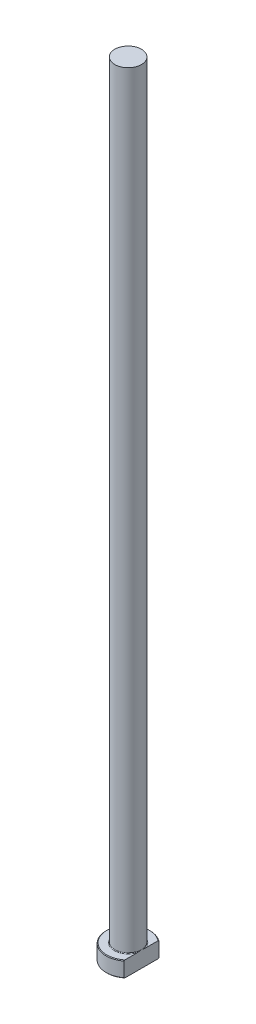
ISO-10303-21;
HEADER;
FILE_DESCRIPTION(('STEP AP214'),'2;1');
FILE_NAME('part.step','',(''),(''),'','','');
FILE_SCHEMA(('AUTOMOTIVE_DESIGN { 1 0 10303 214 1 1 1 1 }'));
ENDSEC;
DATA;
#1=APPLICATION_CONTEXT('core data for automotive mechanical design processes');
#2=APPLICATION_PROTOCOL_DEFINITION('international standard','automotive_design',2000,#1);
#3=PRODUCT_CONTEXT('',#1,'mechanical');
#4=PRODUCT('Part','Part','',(#3));
#5=PRODUCT_RELATED_PRODUCT_CATEGORY('part','',(#4));
#6=PRODUCT_DEFINITION_FORMATION('','',#4);
#7=PRODUCT_DEFINITION_CONTEXT('part definition',#1,'design');
#8=PRODUCT_DEFINITION('design','',#6,#7);
#9=PRODUCT_DEFINITION_SHAPE('','',#8);
#10=(LENGTH_UNIT() NAMED_UNIT(*) SI_UNIT(.MILLI.,.METRE.));
#11=(NAMED_UNIT(*) PLANE_ANGLE_UNIT() SI_UNIT($,.RADIAN.));
#12=(NAMED_UNIT(*) SI_UNIT($,.STERADIAN.) SOLID_ANGLE_UNIT());
#13=UNCERTAINTY_MEASURE_WITH_UNIT(LENGTH_MEASURE(1.E-05),#10,'distance_accuracy_value','');
#14=(GEOMETRIC_REPRESENTATION_CONTEXT(3) GLOBAL_UNCERTAINTY_ASSIGNED_CONTEXT((#13)) GLOBAL_UNIT_ASSIGNED_CONTEXT((#10,
#11,#12)) REPRESENTATION_CONTEXT('',''));
#15=CARTESIAN_POINT('',(0.,0.,0.));
#16=DIRECTION('',(0.,0.,1.));
#17=DIRECTION('',(1.,0.,0.));
#18=AXIS2_PLACEMENT_3D('',#15,#16,#17);
#19=CARTESIAN_POINT('',(0.,0.,0.));
#20=DIRECTION('',(0.,-1.,0.));
#21=DIRECTION('',(0.,0.,-1.));
#22=AXIS2_PLACEMENT_3D('',#19,#20,#21);
#23=PLANE('',#22);
#24=CARTESIAN_POINT('',(0.,0.,0.));
#25=DIRECTION('',(0.,-1.,0.));
#26=DIRECTION('',(0.,0.,-1.));
#27=AXIS2_PLACEMENT_3D('',#24,#25,#26);
#28=CIRCLE('',#27,6.79999999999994);
#29=CARTESIAN_POINT('',(4.24999999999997,0.,5.30824829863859));
#30=VERTEX_POINT('',#29);
#31=CARTESIAN_POINT('',(4.24999999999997,0.,-5.30824829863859));
#32=VERTEX_POINT('',#31);
#33=EDGE_CURVE('E98',#30,#32,#28,.T.);
#34=ORIENTED_EDGE('',*,*,#33,.T.);
#35=DIRECTION('',(0.,0.,1.));
#36=VECTOR('',#35,1.);
#37=CARTESIAN_POINT('',(4.24999999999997,0.,-5.56214886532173));
#38=LINE('',#37,#36);
#39=EDGE_CURVE('E83',#32,#30,#38,.T.);
#40=ORIENTED_EDGE('',*,*,#39,.T.);
#41=EDGE_LOOP('',(#34,#40));
#42=FACE_BOUND('',#41,.T.);
#43=ADVANCED_FACE('F32',(#42),#23,.T.);
#44=CARTESIAN_POINT('',(0.,259.958771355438,0.));
#45=DIRECTION('',(0.,1.,0.));
#46=DIRECTION('',(0.,0.,1.));
#47=AXIS2_PLACEMENT_3D('',#44,#45,#46);
#48=CYLINDRICAL_SURFACE('',#47,6.99999999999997);
#49=CARTESIAN_POINT('',(0.,4.80000000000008,0.));
#50=DIRECTION('',(0.,1.,0.));
#51=DIRECTION('',(0.,0.,1.));
#52=AXIS2_PLACEMENT_3D('',#49,#50,#51);
#53=CIRCLE('',#52,6.99999999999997);
#54=CARTESIAN_POINT('',(4.24999999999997,4.80000000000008,5.56214886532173));
#55=VERTEX_POINT('',#54);
#56=CARTESIAN_POINT('',(4.24999999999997,4.80000000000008,-5.56214886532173));
#57=VERTEX_POINT('',#56);
#58=EDGE_CURVE('E104',#55,#57,#53,.F.);
#59=ORIENTED_EDGE('',*,*,#58,.T.);
#60=DIRECTION('',(0.,-1.,0.));
#61=VECTOR('',#60,1.);
#62=CARTESIAN_POINT('',(4.24999999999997,250.,-5.56214886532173));
#63=LINE('',#62,#61);
#64=CARTESIAN_POINT('',(4.24999999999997,0.200000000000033,-5.56214886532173));
#65=VERTEX_POINT('',#64);
#66=EDGE_CURVE('E183',#57,#65,#63,.T.);
#67=ORIENTED_EDGE('',*,*,#66,.T.);
#68=CARTESIAN_POINT('',(0.,0.200000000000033,0.));
#69=DIRECTION('',(0.,-1.,0.));
#70=DIRECTION('',(0.,0.,-1.));
#71=AXIS2_PLACEMENT_3D('',#68,#69,#70);
#72=CIRCLE('',#71,6.99999999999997);
#73=CARTESIAN_POINT('',(4.24999999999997,0.200000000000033,5.56214886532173));
#74=VERTEX_POINT('',#73);
#75=EDGE_CURVE('E100',#65,#74,#72,.F.);
#76=ORIENTED_EDGE('',*,*,#75,.T.);
#77=DIRECTION('',(0.,-1.,0.));
#78=VECTOR('',#77,1.);
#79=CARTESIAN_POINT('',(4.24999999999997,250.,5.56214886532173));
#80=LINE('',#79,#78);
#81=EDGE_CURVE('E93',#55,#74,#80,.T.);
#82=ORIENTED_EDGE('',*,*,#81,.F.);
#83=EDGE_LOOP('',(#59,#67,#76,#82));
#84=FACE_BOUND('',#83,.T.);
#85=ADVANCED_FACE('F158',(#84),#48,.T.);
#86=CARTESIAN_POINT('',(-6.99999999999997,5.,0.));
#87=DIRECTION('',(0.,1.,0.));
#88=DIRECTION('',(0.,0.,1.));
#89=AXIS2_PLACEMENT_3D('',#86,#87,#88);
#90=PLANE('',#89);
#91=CARTESIAN_POINT('',(0.,5.,0.));
#92=DIRECTION('',(0.,1.,0.));
#93=DIRECTION('',(0.,0.,1.));
#94=AXIS2_PLACEMENT_3D('',#91,#92,#93);
#95=CIRCLE('',#94,6.80000000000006);
#96=CARTESIAN_POINT('',(4.24999999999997,5.,-5.30824829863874));
#97=VERTEX_POINT('',#96);
#98=CARTESIAN_POINT('',(4.24999999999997,5.,5.30824829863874));
#99=VERTEX_POINT('',#98);
#100=EDGE_CURVE('E178',#97,#99,#95,.T.);
#101=ORIENTED_EDGE('',*,*,#100,.T.);
#102=DIRECTION('',(0.,0.,-1.));
#103=VECTOR('',#102,1.);
#104=CARTESIAN_POINT('',(4.24999999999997,5.,0.));
#105=LINE('',#104,#103);
#106=CARTESIAN_POINT('',(4.24999999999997,4.99999999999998,1.31909059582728));
#107=VERTEX_POINT('',#106);
#108=EDGE_CURVE('E57',#99,#107,#105,.T.);
#109=ORIENTED_EDGE('',*,*,#108,.T.);
#110=CARTESIAN_POINT('',(0.,5.,0.));
#111=DIRECTION('',(0.,1.,0.));
#112=DIRECTION('',(0.,0.,1.));
#113=AXIS2_PLACEMENT_3D('',#110,#111,#112);
#114=CIRCLE('',#113,4.44999999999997);
#115=CARTESIAN_POINT('',(4.24999999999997,4.99999999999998,-1.31909059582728));
#116=VERTEX_POINT('',#115);
#117=EDGE_CURVE('E107',#107,#116,#114,.F.);
#118=ORIENTED_EDGE('',*,*,#117,.T.);
#119=EDGE_CURVE('E136',#116,#97,#105,.T.);
#120=ORIENTED_EDGE('',*,*,#119,.T.);
#121=EDGE_LOOP('',(#101,#109,#118,#120));
#122=FACE_BOUND('',#121,.T.);
#123=ADVANCED_FACE('F147',(#122),#90,.T.);
#124=CARTESIAN_POINT('',(0.,5.,0.));
#125=DIRECTION('',(0.,-1.,0.));
#126=DIRECTION('',(0.,0.,-1.));
#127=AXIS2_PLACEMENT_3D('',#124,#125,#126);
#128=CONICAL_SURFACE('',#127,6.80000000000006,0.785398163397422);
#129=ORIENTED_EDGE('',*,*,#58,.F.);
#130=CARTESIAN_POINT('',(4.24999999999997,-1.1549717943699,12.2380061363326));
#131=CARTESIAN_POINT('',(4.24999999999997,-0.96860090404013,12.0407126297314));
#132=CARTESIAN_POINT('',(4.24999999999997,-0.782481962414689,11.843180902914));
#133=CARTESIAN_POINT('',(4.24999999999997,-0.410835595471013,11.4475596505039));
#134=CARTESIAN_POINT('',(4.24999999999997,-0.225308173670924,11.2494701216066));
#135=CARTESIAN_POINT('',(4.24999999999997,0.330615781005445,10.6538566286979));
#136=CARTESIAN_POINT('',(4.24999999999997,0.699987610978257,10.2553749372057));
#137=CARTESIAN_POINT('',(4.24999999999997,1.44820689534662,9.44056382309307));
#138=CARTESIAN_POINT('',(4.24999999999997,1.82691721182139,9.02410803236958));
#139=CARTESIAN_POINT('',(4.24999999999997,2.3903883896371,8.39564122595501));
#140=CARTESIAN_POINT('',(4.24999999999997,2.5773639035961,8.18561642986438));
#141=CARTESIAN_POINT('',(4.24999999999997,2.94948531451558,7.76395344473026));
#142=CARTESIAN_POINT('',(4.24999999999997,3.1346312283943,7.55231527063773));
#143=CARTESIAN_POINT('',(4.24999999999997,3.50243810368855,7.12729701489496));
#144=CARTESIAN_POINT('',(4.24999999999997,3.68510158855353,6.91391912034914));
#145=CARTESIAN_POINT('',(4.24999999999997,4.04753998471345,6.48470257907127));
#146=CARTESIAN_POINT('',(4.24999999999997,4.22731476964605,6.26886382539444));
#147=CARTESIAN_POINT('',(4.24999999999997,4.58362310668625,5.83346482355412));
#148=CARTESIAN_POINT('',(4.24999999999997,4.76014565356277,5.61389554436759));
#149=CARTESIAN_POINT('',(4.24999999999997,5.10813954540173,5.17081545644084));
#150=CARTESIAN_POINT('',(4.24999999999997,5.27961153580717,4.94730515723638));
#151=CARTESIAN_POINT('',(4.24999999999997,5.61292794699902,4.49883470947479));
#152=CARTESIAN_POINT('',(4.24999999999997,5.77488381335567,4.2739577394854));
#153=CARTESIAN_POINT('',(4.24999999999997,6.08959034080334,3.8175542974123));
#154=CARTESIAN_POINT('',(4.24999999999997,6.24233528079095,3.58602382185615));
#155=CARTESIAN_POINT('',(4.24999999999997,6.46088242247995,3.23296927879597));
#156=CARTESIAN_POINT('',(4.24999999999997,6.53180994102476,3.11461948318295));
#157=CARTESIAN_POINT('',(4.24999999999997,6.66953191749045,2.87554671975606));
#158=CARTESIAN_POINT('',(4.24999999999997,6.73632692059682,2.75482406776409));
#159=CARTESIAN_POINT('',(4.24999999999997,6.86480050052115,2.51086229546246));
#160=CARTESIAN_POINT('',(4.24999999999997,6.92648531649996,2.38762647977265));
#161=CARTESIAN_POINT('',(4.24999999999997,7.04367856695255,2.13827051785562));
#162=CARTESIAN_POINT('',(4.24999999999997,7.09918867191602,2.0121511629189));
#163=CARTESIAN_POINT('',(4.24999999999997,7.20212054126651,1.75821381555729));
#164=CARTESIAN_POINT('',(4.24999999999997,7.24962333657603,1.63042897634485));
#165=CARTESIAN_POINT('',(4.24999999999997,7.33574687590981,1.37182854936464));
#166=CARTESIAN_POINT('',(4.24999999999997,7.37436534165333,1.24101219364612));
#167=CARTESIAN_POINT('',(4.24999999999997,7.44090399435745,0.977431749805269));
#168=CARTESIAN_POINT('',(4.24999999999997,7.46888314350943,0.844682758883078));
#169=CARTESIAN_POINT('',(4.24999999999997,7.51300819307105,0.577216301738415));
#170=CARTESIAN_POINT('',(4.24999999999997,7.52915548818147,0.442499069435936));
#171=CARTESIAN_POINT('',(4.24999999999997,7.54874331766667,0.170860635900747));
#172=CARTESIAN_POINT('',(4.24999999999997,7.55206380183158,0.0339306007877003));
#173=CARTESIAN_POINT('',(4.24999999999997,7.54544836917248,-0.239598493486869));
#174=CARTESIAN_POINT('',(4.24999999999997,7.53551276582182,-0.376197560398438));
#175=CARTESIAN_POINT('',(4.24999999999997,7.50295253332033,-0.648437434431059));
#176=CARTESIAN_POINT('',(4.24999999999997,7.48027427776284,-0.784071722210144));
#177=CARTESIAN_POINT('',(4.24999999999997,7.42348982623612,-1.05291460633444));
#178=CARTESIAN_POINT('',(4.24999999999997,7.38938084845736,-1.18612260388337));
#179=CARTESIAN_POINT('',(4.24999999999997,7.29188531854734,-1.51531404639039));
#180=CARTESIAN_POINT('',(4.24999999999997,7.22238075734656,-1.70947814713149));
#181=CARTESIAN_POINT('',(4.24999999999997,7.06668741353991,-2.0909759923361));
#182=CARTESIAN_POINT('',(4.24999999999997,6.9804865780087,-2.278304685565));
#183=CARTESIAN_POINT('',(4.24999999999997,6.84149476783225,-2.55552751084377));
#184=CARTESIAN_POINT('',(4.24999999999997,6.79327931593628,-2.64776502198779));
#185=CARTESIAN_POINT('',(4.24999999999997,6.69413480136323,-2.83077431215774));
#186=CARTESIAN_POINT('',(4.24999999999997,6.64320570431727,-2.92154607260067));
#187=CARTESIAN_POINT('',(4.24999999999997,6.53904474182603,-3.10170103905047));
#188=CARTESIAN_POINT('',(4.24999999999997,6.4858138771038,-3.19108482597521));
#189=CARTESIAN_POINT('',(4.24999999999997,6.3773472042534,-3.368618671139));
#190=CARTESIAN_POINT('',(4.24999999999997,6.32211148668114,-3.45676878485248));
#191=CARTESIAN_POINT('',(4.24999999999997,6.13027123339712,-3.75631659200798));
#192=CARTESIAN_POINT('',(4.24999999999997,5.98947006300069,-3.9650308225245));
#193=CARTESIAN_POINT('',(4.24999999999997,5.70061349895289,-4.37739745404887));
#194=CARTESIAN_POINT('',(4.24999999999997,5.55255625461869,-4.58104854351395));
#195=CARTESIAN_POINT('',(4.24999999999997,5.25096308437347,-4.98451036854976));
#196=CARTESIAN_POINT('',(4.24999999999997,5.09742258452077,-5.1843176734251));
#197=CARTESIAN_POINT('',(4.24999999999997,4.78630665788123,-5.58072220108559));
#198=CARTESIAN_POINT('',(4.24999999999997,4.62873161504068,-5.77731972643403));
#199=CARTESIAN_POINT('',(4.24999999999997,4.30987074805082,-6.16866624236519));
#200=CARTESIAN_POINT('',(4.24999999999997,4.14857352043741,-6.36340591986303));
#201=CARTESIAN_POINT('',(4.24999999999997,3.82349048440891,-6.75079948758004));
#202=CARTESIAN_POINT('',(4.24999999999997,3.65970462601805,-6.94345333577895));
#203=CARTESIAN_POINT('',(4.24999999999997,3.33022176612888,-7.32695469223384));
#204=CARTESIAN_POINT('',(4.24999999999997,3.16452573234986,-7.51780303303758));
#205=CARTESIAN_POINT('',(4.24999999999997,2.83151234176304,-7.89808083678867));
#206=CARTESIAN_POINT('',(4.24999999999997,2.66419497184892,-8.08751028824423));
#207=CARTESIAN_POINT('',(4.24999999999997,2.19674563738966,-8.61299836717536));
#208=CARTESIAN_POINT('',(4.24999999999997,1.89516668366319,-8.94776953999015));
#209=CARTESIAN_POINT('',(4.24999999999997,1.28890266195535,-9.61456394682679));
#210=CARTESIAN_POINT('',(4.24999999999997,0.984217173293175,-9.94658679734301));
#211=CARTESIAN_POINT('',(4.24999999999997,0.374739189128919,-10.6061264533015));
#212=CARTESIAN_POINT('',(4.24999999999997,0.0699631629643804,-10.9336584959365));
#213=CARTESIAN_POINT('',(4.24999999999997,-0.541317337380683,-11.5870007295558));
#214=CARTESIAN_POINT('',(4.24999999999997,-0.847821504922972,-11.9128112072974));
#215=CARTESIAN_POINT('',(4.24999999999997,-1.15497179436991,-12.2380061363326));
#216=B_SPLINE_CURVE_WITH_KNOTS('',3,(#130,#131,#132,#133,#134,#135,#136,#137,#138,#139,#140,
#141,#142,#143,#144,#145,#146,#147,#148,#149,#150,#151,#152,#153,#154,#155,#156,#157,#158,#159,
#160,#161,#162,#163,#164,#165,#166,#167,#168,#169,#170,#171,#172,#173,#174,#175,#176,#177,#178,
#179,#180,#181,#182,#183,#184,#185,#186,#187,#188,#189,#190,#191,#192,#193,#194,#195,#196,#197,
#198,#199,#200,#201,#202,#203,#204,#205,#206,#207,#208,#209,#210,#211,#212,#213,#214,#215),
.UNSPECIFIED.,.F.,.F.,(4,2,2,2,2,2,2,2,2,2,2,2,2,2,2,2,2,2,2,2,2,2,2,2,2,2,2,2,2,2,2,2,2,2,2,2,
2,2,2,2,2,2,4),(0.,0.814204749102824,1.62841433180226,3.25843263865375,4.94708916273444,
5.79066412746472,6.63423128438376,7.47686481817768,8.31953511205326,9.16466757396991,
10.0096915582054,10.8409260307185,11.6726715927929,12.0865355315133,12.500344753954,
12.9136410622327,13.3268252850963,13.7355380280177,14.1443554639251,14.5508730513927,
14.9573427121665,15.3676075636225,15.777862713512,16.1898574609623,16.6019525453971,
17.2195383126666,17.8375715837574,18.1497730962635,18.461978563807,18.7740496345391,
19.0861066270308,19.8411596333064,20.5964062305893,21.3522982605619,22.1081186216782,
22.8666854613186,23.6252675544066,24.3834808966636,25.141700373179,26.4934084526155,
27.845302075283,29.1874909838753,30.5294487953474),.UNSPECIFIED.);
#217=EDGE_CURVE('E135',#55,#99,#216,.T.);
#218=ORIENTED_EDGE('',*,*,#217,.T.);
#219=ORIENTED_EDGE('',*,*,#100,.F.);
#220=EDGE_CURVE('E127',#97,#57,#216,.T.);
#221=ORIENTED_EDGE('',*,*,#220,.T.);
#222=EDGE_LOOP('',(#129,#218,#219,#221));
#223=FACE_BOUND('',#222,.T.);
#224=ADVANCED_FACE('F143',(#223),#128,.T.);
#225=CARTESIAN_POINT('',(0.,0.200000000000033,0.));
#226=DIRECTION('',(0.,1.,0.));
#227=DIRECTION('',(0.,0.,1.));
#228=AXIS2_PLACEMENT_3D('',#225,#226,#227);
#229=CONICAL_SURFACE('',#228,6.99999999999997,0.785398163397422);
#230=ORIENTED_EDGE('',*,*,#75,.F.);
#231=CARTESIAN_POINT('',(4.24999999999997,6.15497179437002,-12.2380061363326));
#232=CARTESIAN_POINT('',(4.24999999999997,5.96860090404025,-12.0407126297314));
#233=CARTESIAN_POINT('',(4.24999999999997,5.78248196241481,-11.843180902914));
#234=CARTESIAN_POINT('',(4.24999999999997,5.41083559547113,-11.4475596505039));
#235=CARTESIAN_POINT('',(4.24999999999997,5.22530817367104,-11.2494701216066));
#236=CARTESIAN_POINT('',(4.24999999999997,4.66938421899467,-10.6538566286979));
#237=CARTESIAN_POINT('',(4.24999999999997,4.30001238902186,-10.2553749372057));
#238=CARTESIAN_POINT('',(4.24999999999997,3.5517931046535,-9.44056382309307));
#239=CARTESIAN_POINT('',(4.24999999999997,3.17308278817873,-9.02410803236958));
#240=CARTESIAN_POINT('',(4.24999999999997,2.60961161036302,-8.39564122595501));
#241=CARTESIAN_POINT('',(4.24999999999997,2.42263609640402,-8.18561642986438));
#242=CARTESIAN_POINT('',(4.24999999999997,2.05051468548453,-7.76395344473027));
#243=CARTESIAN_POINT('',(4.24999999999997,1.86536877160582,-7.55231527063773));
#244=CARTESIAN_POINT('',(4.24999999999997,1.49756189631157,-7.12729701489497));
#245=CARTESIAN_POINT('',(4.24999999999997,1.31489841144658,-6.91391912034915));
#246=CARTESIAN_POINT('',(4.24999999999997,0.95246001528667,-6.48470257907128));
#247=CARTESIAN_POINT('',(4.24999999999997,0.772685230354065,-6.26886382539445));
#248=CARTESIAN_POINT('',(4.24999999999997,0.416376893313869,-5.83346482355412));
#249=CARTESIAN_POINT('',(4.24999999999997,0.239854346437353,-5.61389554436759));
#250=CARTESIAN_POINT('',(4.24999999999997,-0.108139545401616,-5.17081545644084));
#251=CARTESIAN_POINT('',(4.24999999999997,-0.279611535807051,-4.94730515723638));
#252=CARTESIAN_POINT('',(4.24999999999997,-0.612927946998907,-4.4988347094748));
#253=CARTESIAN_POINT('',(4.24999999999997,-0.77488381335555,-4.2739577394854));
#254=CARTESIAN_POINT('',(4.24999999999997,-1.08959034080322,-3.8175542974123));
#255=CARTESIAN_POINT('',(4.24999999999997,-1.24233528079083,-3.58602382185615));
#256=CARTESIAN_POINT('',(4.24999999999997,-1.46088242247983,-3.23296927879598));
#257=CARTESIAN_POINT('',(4.24999999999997,-1.53180994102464,-3.11461948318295));
#258=CARTESIAN_POINT('',(4.24999999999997,-1.66953191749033,-2.87554671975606));
#259=CARTESIAN_POINT('',(4.24999999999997,-1.7363269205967,-2.75482406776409));
#260=CARTESIAN_POINT('',(4.24999999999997,-1.86480050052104,-2.51086229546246));
#261=CARTESIAN_POINT('',(4.24999999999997,-1.92648531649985,-2.38762647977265));
#262=CARTESIAN_POINT('',(4.24999999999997,-2.04367856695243,-2.13827051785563));
#263=CARTESIAN_POINT('',(4.24999999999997,-2.0991886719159,-2.0121511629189));
#264=CARTESIAN_POINT('',(4.24999999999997,-2.20212054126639,-1.75821381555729));
#265=CARTESIAN_POINT('',(4.24999999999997,-2.24962333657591,-1.63042897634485));
#266=CARTESIAN_POINT('',(4.24999999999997,-2.33574687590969,-1.37182854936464));
#267=CARTESIAN_POINT('',(4.24999999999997,-2.37436534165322,-1.24101219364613));
#268=CARTESIAN_POINT('',(4.24999999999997,-2.44090399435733,-0.977431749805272));
#269=CARTESIAN_POINT('',(4.24999999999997,-2.46888314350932,-0.844682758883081));
#270=CARTESIAN_POINT('',(4.24999999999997,-2.51300819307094,-0.577216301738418));
#271=CARTESIAN_POINT('',(4.24999999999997,-2.52915548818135,-0.44249906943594));
#272=CARTESIAN_POINT('',(4.24999999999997,-2.54874331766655,-0.170860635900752));
#273=CARTESIAN_POINT('',(4.24999999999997,-2.55206380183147,-0.0339306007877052));
#274=CARTESIAN_POINT('',(4.24999999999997,-2.54544836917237,0.239598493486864));
#275=CARTESIAN_POINT('',(4.24999999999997,-2.5355127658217,0.376197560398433));
#276=CARTESIAN_POINT('',(4.24999999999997,-2.50295253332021,0.648437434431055));
#277=CARTESIAN_POINT('',(4.24999999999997,-2.48027427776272,0.784071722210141));
#278=CARTESIAN_POINT('',(4.24999999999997,-2.42348982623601,1.05291460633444));
#279=CARTESIAN_POINT('',(4.24999999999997,-2.38938084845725,1.18612260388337));
#280=CARTESIAN_POINT('',(4.24999999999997,-2.29188531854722,1.51531404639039));
#281=CARTESIAN_POINT('',(4.24999999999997,-2.22238075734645,1.70947814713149));
#282=CARTESIAN_POINT('',(4.24999999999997,-2.0666874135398,2.09097599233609));
#283=CARTESIAN_POINT('',(4.24999999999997,-1.98048657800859,2.278304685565));
#284=CARTESIAN_POINT('',(4.24999999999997,-1.84149476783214,2.55552751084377));
#285=CARTESIAN_POINT('',(4.24999999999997,-1.79327931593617,2.64776502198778));
#286=CARTESIAN_POINT('',(4.24999999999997,-1.69413480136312,2.83077431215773));
#287=CARTESIAN_POINT('',(4.24999999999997,-1.64320570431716,2.92154607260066));
#288=CARTESIAN_POINT('',(4.24999999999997,-1.53904474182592,3.10170103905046));
#289=CARTESIAN_POINT('',(4.24999999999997,-1.48581387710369,3.1910848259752));
#290=CARTESIAN_POINT('',(4.24999999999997,-1.37734720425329,3.36861867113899));
#291=CARTESIAN_POINT('',(4.24999999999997,-1.32211148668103,3.45676878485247));
#292=CARTESIAN_POINT('',(4.24999999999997,-1.13027123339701,3.75631659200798));
#293=CARTESIAN_POINT('',(4.24999999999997,-0.989470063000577,3.96503082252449));
#294=CARTESIAN_POINT('',(4.24999999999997,-0.700613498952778,4.37739745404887));
#295=CARTESIAN_POINT('',(4.24999999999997,-0.552556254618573,4.58104854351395));
#296=CARTESIAN_POINT('',(4.24999999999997,-0.250963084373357,4.98451036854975));
#297=CARTESIAN_POINT('',(4.24999999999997,-0.0974225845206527,5.1843176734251));
#298=CARTESIAN_POINT('',(4.24999999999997,0.213693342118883,5.58072220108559));
#299=CARTESIAN_POINT('',(4.24999999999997,0.371268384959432,5.77731972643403));
#300=CARTESIAN_POINT('',(4.24999999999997,0.690129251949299,6.16866624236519));
#301=CARTESIAN_POINT('',(4.24999999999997,0.851426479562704,6.36340591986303));
#302=CARTESIAN_POINT('',(4.24999999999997,1.17650951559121,6.75079948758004));
#303=CARTESIAN_POINT('',(4.24999999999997,1.34029537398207,6.94345333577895));
#304=CARTESIAN_POINT('',(4.24999999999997,1.66977823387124,7.32695469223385));
#305=CARTESIAN_POINT('',(4.24999999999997,1.83547426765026,7.51780303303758));
#306=CARTESIAN_POINT('',(4.24999999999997,2.16848765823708,7.89808083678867));
#307=CARTESIAN_POINT('',(4.24999999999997,2.3358050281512,8.08751028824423));
#308=CARTESIAN_POINT('',(4.24999999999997,2.80325436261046,8.61299836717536));
#309=CARTESIAN_POINT('',(4.24999999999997,3.10483331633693,8.94776953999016));
#310=CARTESIAN_POINT('',(4.24999999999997,3.71109733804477,9.6145639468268));
#311=CARTESIAN_POINT('',(4.24999999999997,4.01578282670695,9.94658679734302));
#312=CARTESIAN_POINT('',(4.24999999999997,4.6252608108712,10.6061264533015));
#313=CARTESIAN_POINT('',(4.24999999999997,4.93003683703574,10.9336584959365));
#314=CARTESIAN_POINT('',(4.24999999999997,5.5413173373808,11.5870007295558));
#315=CARTESIAN_POINT('',(4.24999999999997,5.84782150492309,11.9128112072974));
#316=CARTESIAN_POINT('',(4.24999999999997,6.15497179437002,12.2380061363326));
#317=B_SPLINE_CURVE_WITH_KNOTS('',3,(#231,#232,#233,#234,#235,#236,#237,#238,#239,#240,#241,
#242,#243,#244,#245,#246,#247,#248,#249,#250,#251,#252,#253,#254,#255,#256,#257,#258,#259,#260,
#261,#262,#263,#264,#265,#266,#267,#268,#269,#270,#271,#272,#273,#274,#275,#276,#277,#278,#279,
#280,#281,#282,#283,#284,#285,#286,#287,#288,#289,#290,#291,#292,#293,#294,#295,#296,#297,#298,
#299,#300,#301,#302,#303,#304,#305,#306,#307,#308,#309,#310,#311,#312,#313,#314,#315,#316),
.UNSPECIFIED.,.F.,.F.,(4,2,2,2,2,2,2,2,2,2,2,2,2,2,2,2,2,2,2,2,2,2,2,2,2,2,2,2,2,2,2,2,2,2,2,2,
2,2,2,2,2,2,4),(0.,0.814204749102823,1.62841433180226,3.25843263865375,4.94708916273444,
5.79066412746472,6.63423128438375,7.47686481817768,8.31953511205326,9.16466757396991,
10.0096915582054,10.8409260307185,11.6726715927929,12.0865355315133,12.500344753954,
12.9136410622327,13.3268252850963,13.7355380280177,14.1443554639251,14.5508730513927,
14.9573427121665,15.3676075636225,15.777862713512,16.1898574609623,16.6019525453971,
17.2195383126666,17.8375715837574,18.1497730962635,18.461978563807,18.7740496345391,
19.0861066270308,19.8411596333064,20.5964062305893,21.3522982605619,22.1081186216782,
22.8666854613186,23.6252675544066,24.3834808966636,25.141700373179,26.4934084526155,
27.845302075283,29.1874909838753,30.5294487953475),.UNSPECIFIED.);
#318=EDGE_CURVE('E86',#65,#32,#317,.T.);
#319=ORIENTED_EDGE('',*,*,#318,.T.);
#320=ORIENTED_EDGE('',*,*,#33,.F.);
#321=EDGE_CURVE('E89',#30,#74,#317,.T.);
#322=ORIENTED_EDGE('',*,*,#321,.T.);
#323=EDGE_LOOP('',(#230,#319,#320,#322));
#324=FACE_BOUND('',#323,.T.);
#325=ADVANCED_FACE('F97',(#324),#229,.T.);
#326=CARTESIAN_POINT('',(0.,5.19999999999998,0.));
#327=DIRECTION('',(0.,1.,0.));
#328=DIRECTION('',(0.,0.,1.));
#329=AXIS2_PLACEMENT_3D('',#326,#327,#328);
#330=TOROIDAL_SURFACE('',#329,4.44999999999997,0.2);
#331=CARTESIAN_POINT('',(4.24999999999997,5.19999999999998,0.));
#332=CARTESIAN_POINT('',(4.24999999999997,5.20000051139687,1.15744821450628E-10));
#333=CARTESIAN_POINT('',(4.24999999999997,5.20000102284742,-2.4293169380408E-07));
#334=CARTESIAN_POINT('',(4.24999999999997,5.20000197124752,-8.87321860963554E-07));
#335=CARTESIAN_POINT('',(4.24999999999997,5.20000238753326,-1.30614850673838E-06));
#336=CARTESIAN_POINT('',(4.24999999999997,5.20000327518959,-2.31752643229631E-06));
#337=CARTESIAN_POINT('',(4.24999999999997,5.20000373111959,-2.92646131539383E-06));
#338=CARTESIAN_POINT('',(4.24999999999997,5.200004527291,-4.16981951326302E-06));
#339=CARTESIAN_POINT('',(4.24999999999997,5.2000048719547,-4.80170872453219E-06));
#340=CARTESIAN_POINT('',(4.24999999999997,5.20000620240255,-7.3194814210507E-06));
#341=CARTESIAN_POINT('',(4.24999999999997,5.20000712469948,-9.24257745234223E-06));
#342=CARTESIAN_POINT('',(4.24999999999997,5.20000859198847,-1.29952261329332E-05));
#343=CARTESIAN_POINT('',(4.24999999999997,5.20000916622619,-1.48137375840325E-05));
#344=CARTESIAN_POINT('',(4.24999999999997,5.20001166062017,-2.2701068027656E-05));
#345=CARTESIAN_POINT('',(4.24999999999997,5.20001358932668,-2.87689532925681E-05));
#346=CARTESIAN_POINT('',(4.24999999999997,5.20001634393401,-4.00958698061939E-05));
#347=CARTESIAN_POINT('',(4.24999999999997,5.20001729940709,-4.53228601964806E-05));
#348=CARTESIAN_POINT('',(4.24999999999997,5.20002438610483,-8.47086375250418E-05));
#349=CARTESIAN_POINT('',(4.24999999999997,5.20002990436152,-0.000118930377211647));
#350=CARTESIAN_POINT('',(4.24999999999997,5.20005405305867,-0.000255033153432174));
#351=CARTESIAN_POINT('',(4.24999999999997,5.20007694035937,-0.00035616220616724));
#352=CARTESIAN_POINT('',(4.24999999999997,5.20016675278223,-0.000759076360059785));
#353=CARTESIAN_POINT('',(4.24999999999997,5.20023104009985,-0.00106124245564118));
#354=CARTESIAN_POINT('',(4.24999999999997,5.20048990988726,-0.00226975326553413));
#355=CARTESIAN_POINT('',(4.24999999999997,5.20068789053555,-0.00317558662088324));
#356=CARTESIAN_POINT('',(4.24999999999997,5.20151472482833,-0.00696787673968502));
#357=CARTESIAN_POINT('',(4.24999999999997,5.2021393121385,-0.00985497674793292));
#358=CARTESIAN_POINT('',(4.24999999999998,5.21047485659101,-0.0483744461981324));
#359=CARTESIAN_POINT('',(4.24999999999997,5.21821166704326,-0.0840032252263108));
#360=CARTESIAN_POINT('',(4.24999999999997,5.23443934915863,-0.15925743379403));
#361=CARTESIAN_POINT('',(4.24999999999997,5.24291807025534,-0.198885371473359));
#362=CARTESIAN_POINT('',(4.24999999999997,5.25719269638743,-0.266483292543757));
#363=CARTESIAN_POINT('',(4.24999999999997,5.2630418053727,-0.294441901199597));
#364=CARTESIAN_POINT('',(4.24999999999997,5.27443459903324,-0.349631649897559));
#365=CARTESIAN_POINT('',(4.24999999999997,5.27998226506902,-0.37686197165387));
#366=CARTESIAN_POINT('',(4.24999999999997,5.29789349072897,-0.466265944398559));
#367=CARTESIAN_POINT('',(4.24999999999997,5.3098841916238,-0.528515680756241));
#368=CARTESIAN_POINT('',(4.24999999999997,5.33255488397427,-0.653873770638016));
#369=CARTESIAN_POINT('',(4.24999999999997,5.34322118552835,-0.716984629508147));
#370=CARTESIAN_POINT('',(4.24999999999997,5.36341886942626,-0.849542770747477));
#371=CARTESIAN_POINT('',(4.24999999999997,5.37274606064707,-0.919022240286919));
#372=CARTESIAN_POINT('',(4.24999999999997,5.38787342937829,-1.05816998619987));
#373=CARTESIAN_POINT('',(4.24999999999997,5.39368393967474,-1.12783709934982));
#374=CARTESIAN_POINT('',(4.24999999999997,5.40022105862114,-1.26519903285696));
#375=CARTESIAN_POINT('',(4.24999999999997,5.40110718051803,-1.33288413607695));
#376=CARTESIAN_POINT('',(4.24999999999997,5.39715260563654,-1.43372383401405));
#377=CARTESIAN_POINT('',(4.24999999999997,5.39498924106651,-1.46697561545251));
#378=CARTESIAN_POINT('',(4.24999999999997,5.38843757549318,-1.53323057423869));
#379=CARTESIAN_POINT('',(4.24999999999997,5.38405165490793,-1.56623397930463));
#380=CARTESIAN_POINT('',(4.24999999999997,5.37221191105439,-1.63225744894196));
#381=CARTESIAN_POINT('',(4.24999999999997,5.36471302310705,-1.665270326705));
#382=CARTESIAN_POINT('',(4.24999999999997,5.35002141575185,-1.71373529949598));
#383=CARTESIAN_POINT('',(4.24999999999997,5.3445543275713,-1.72970598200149));
#384=CARTESIAN_POINT('',(4.24999999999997,5.33212858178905,-1.76104662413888));
#385=CARTESIAN_POINT('',(4.24999999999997,5.32517291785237,-1.77641771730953));
#386=CARTESIAN_POINT('',(4.24999999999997,5.31157493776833,-1.80173413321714));
#387=CARTESIAN_POINT('',(4.24999999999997,5.30543892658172,-1.81194868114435));
#388=CARTESIAN_POINT('',(4.24999999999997,5.29187259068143,-1.83147712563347));
#389=CARTESIAN_POINT('',(4.24999999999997,5.28444659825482,-1.84079387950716));
#390=CARTESIAN_POINT('',(4.24999999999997,5.27165788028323,-1.8539962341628));
#391=CARTESIAN_POINT('',(4.24999999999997,5.26687308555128,-1.85843752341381));
#392=CARTESIAN_POINT('',(4.24999999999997,5.25674280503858,-1.86663816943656));
#393=CARTESIAN_POINT('',(4.24999999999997,5.25139780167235,-1.87039810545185));
#394=CARTESIAN_POINT('',(4.24999999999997,5.24121545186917,-1.87633128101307));
#395=CARTESIAN_POINT('',(4.24999999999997,5.23647607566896,-1.87867040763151));
#396=CARTESIAN_POINT('',(4.24999999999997,5.22667692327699,-1.88254109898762));
#397=CARTESIAN_POINT('',(4.24999999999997,5.22161755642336,-1.88407367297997));
#398=CARTESIAN_POINT('',(4.24999999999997,5.21125115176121,-1.88618376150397));
#399=CARTESIAN_POINT('',(4.24999999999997,5.20594232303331,-1.8867527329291));
#400=CARTESIAN_POINT('',(4.24999999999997,5.1953165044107,-1.88683483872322));
#401=CARTESIAN_POINT('',(4.24999999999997,5.18999951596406,-1.88634814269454));
#402=CARTESIAN_POINT('',(4.24999999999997,5.18024254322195,-1.88451305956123));
#403=CARTESIAN_POINT('',(4.24999999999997,5.17577879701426,-1.88328567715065));
#404=CARTESIAN_POINT('',(4.24999999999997,5.16708370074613,-1.88018632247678));
#405=CARTESIAN_POINT('',(4.24999999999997,5.16285244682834,-1.87831408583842));
#406=CARTESIAN_POINT('',(4.24999999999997,5.15236530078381,-1.8728422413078));
#407=CARTESIAN_POINT('',(4.24999999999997,5.14630821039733,-1.86886321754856));
#408=CARTESIAN_POINT('',(4.24999999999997,5.13488065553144,-1.8600173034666));
#409=CARTESIAN_POINT('',(4.24999999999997,5.12951236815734,-1.85514771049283));
#410=CARTESIAN_POINT('',(4.24999999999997,5.11550691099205,-1.84083719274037));
#411=CARTESIAN_POINT('',(4.24999999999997,5.10752788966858,-1.83075903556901));
#412=CARTESIAN_POINT('',(4.24999999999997,5.09305704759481,-1.80961650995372));
#413=CARTESIAN_POINT('',(4.24999999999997,5.08656786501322,-1.7985504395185));
#414=CARTESIAN_POINT('',(4.24999999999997,5.07270261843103,-1.77195183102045));
#415=CARTESIAN_POINT('',(4.24999999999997,5.06578110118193,-1.75618509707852));
#416=CARTESIAN_POINT('',(4.24999999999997,5.05343494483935,-1.72406513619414));
#417=CARTESIAN_POINT('',(4.24999999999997,5.04801326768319,-1.70771081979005));
#418=CARTESIAN_POINT('',(4.24999999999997,5.03828568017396,-1.67446840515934));
#419=CARTESIAN_POINT('',(4.24999999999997,5.03399373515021,-1.65757628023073));
#420=CARTESIAN_POINT('',(4.24999999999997,5.02638165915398,-1.62359857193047));
#421=CARTESIAN_POINT('',(4.24999999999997,5.02306049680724,-1.60651321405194));
#422=CARTESIAN_POINT('',(4.24999999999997,5.01554103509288,-1.56237813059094));
#423=CARTESIAN_POINT('',(4.24999999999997,5.01193061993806,-1.53522860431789));
#424=CARTESIAN_POINT('',(4.24999999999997,5.00624732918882,-1.48076491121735));
#425=CARTESIAN_POINT('',(4.24999999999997,5.00417529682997,-1.45345066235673));
#426=CARTESIAN_POINT('',(4.24999999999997,4.99980704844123,-1.37123328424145));
#427=CARTESIAN_POINT('',(4.24999999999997,4.99938405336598,-1.31623108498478));
#428=CARTESIAN_POINT('',(4.24999999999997,5.00195512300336,-1.20937484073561));
#429=CARTESIAN_POINT('',(4.24999999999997,5.00476235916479,-1.15751417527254));
#430=CARTESIAN_POINT('',(4.24999999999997,5.01274020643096,-1.05395255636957));
#431=CARTESIAN_POINT('',(4.24999999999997,5.0179120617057,-1.00225170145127));
#432=CARTESIAN_POINT('',(4.24999999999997,5.0318667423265,-0.883772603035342));
#433=CARTESIAN_POINT('',(4.24999999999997,5.04126554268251,-0.817068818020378));
#434=CARTESIAN_POINT('',(4.24999999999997,5.06248695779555,-0.68230638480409));
#435=CARTESIAN_POINT('',(4.24999999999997,5.0743654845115,-0.614256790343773));
#436=CARTESIAN_POINT('',(4.24999999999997,5.09582131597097,-0.499048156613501));
#437=CARTESIAN_POINT('',(4.24999999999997,5.10500357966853,-0.451814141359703));
#438=CARTESIAN_POINT('',(4.24999999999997,5.1237965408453,-0.357991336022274));
#439=CARTESIAN_POINT('',(4.24999999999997,5.13340116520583,-0.311401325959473));
#440=CARTESIAN_POINT('',(4.24999999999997,5.15180561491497,-0.223687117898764));
#441=CARTESIAN_POINT('',(4.24999999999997,5.16056968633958,-0.182555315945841));
#442=CARTESIAN_POINT('',(4.24999999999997,5.178640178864,-0.0985301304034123));
#443=CARTESIAN_POINT('',(4.24999999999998,5.18795357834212,-0.0556381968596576));
#444=CARTESIAN_POINT('',(4.24999999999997,5.1978622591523,-0.00984762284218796));
#445=CARTESIAN_POINT('',(4.24999999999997,5.19848844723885,-0.00695317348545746));
#446=CARTESIAN_POINT('',(4.24999999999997,5.1993156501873,-0.00315924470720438));
#447=CARTESIAN_POINT('',(4.24999999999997,5.19951238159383,-0.00225911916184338));
#448=CARTESIAN_POINT('',(4.24999999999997,5.19976973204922,-0.00105770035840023));
#449=CARTESIAN_POINT('',(4.24999999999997,5.19983372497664,-0.000756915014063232));
#450=CARTESIAN_POINT('',(4.24999999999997,5.19992318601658,-0.000355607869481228));
#451=CARTESIAN_POINT('',(4.24999999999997,5.19994602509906,-0.000254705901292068));
#452=CARTESIAN_POINT('',(4.24999999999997,5.1999701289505,-0.000118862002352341));
#453=CARTESIAN_POINT('',(4.24999999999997,5.19997564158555,-8.4670569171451E-05));
#454=CARTESIAN_POINT('',(4.24999999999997,5.19998271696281,-4.53159337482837E-05));
#455=CARTESIAN_POINT('',(4.24999999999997,5.19998367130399,-4.00904844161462E-05));
#456=CARTESIAN_POINT('',(4.24999999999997,5.19998642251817,-2.87668536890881E-05));
#457=CARTESIAN_POINT('',(4.24999999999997,5.19998834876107,-2.27006335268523E-05));
#458=CARTESIAN_POINT('',(4.24999999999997,5.19999084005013,-1.48150638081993E-05));
#459=CARTESIAN_POINT('',(4.24999999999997,5.199991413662,-1.29966656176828E-05));
#460=CARTESIAN_POINT('',(4.24999999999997,5.19999287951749,-9.24415318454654E-06));
#461=CARTESIAN_POINT('',(4.24999999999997,5.19999380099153,-7.32106390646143E-06));
#462=CARTESIAN_POINT('',(4.24999999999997,5.19999513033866,-4.8031966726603E-06));
#463=CARTESIAN_POINT('',(4.24999999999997,5.19999547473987,-4.17124743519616E-06));
#464=CARTESIAN_POINT('',(4.24999999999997,5.19999627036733,-2.92772184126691E-06));
#465=CARTESIAN_POINT('',(4.24999999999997,5.19999672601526,-2.31867707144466E-06));
#466=CARTESIAN_POINT('',(4.24999999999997,5.19999761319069,-1.30704757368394E-06));
#467=CARTESIAN_POINT('',(4.24999999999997,5.19999802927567,-8.88090030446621E-07));
#468=CARTESIAN_POINT('',(4.24999999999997,5.19999897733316,-2.43359811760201E-07));
#469=CARTESIAN_POINT('',(4.24999999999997,5.19999948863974,-1.15736528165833E-10));
#470=CARTESIAN_POINT('',(4.24999999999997,5.19999999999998,0.));
#471=B_SPLINE_CURVE_WITH_KNOTS('',3,(#331,#332,#333,#334,#335,#336,#337,#338,#339,#340,#341,
#342,#343,#344,#345,#346,#347,#348,#349,#350,#351,#352,#353,#354,#355,#356,#357,#358,#359,#360,
#361,#362,#363,#364,#365,#366,#367,#368,#369,#370,#371,#372,#373,#374,#375,#376,#377,#378,#379,
#380,#381,#382,#383,#384,#385,#386,#387,#388,#389,#390,#391,#392,#393,#394,#395,#396,#397,#398,
#399,#400,#401,#402,#403,#404,#405,#406,#407,#408,#409,#410,#411,#412,#413,#414,#415,#416,#417,
#418,#419,#420,#421,#422,#423,#424,#425,#426,#427,#428,#429,#430,#431,#432,#433,#434,#435,#436,
#437,#438,#439,#440,#441,#442,#443,#444,#445,#446,#447,#448,#449,#450,#451,#452,#453,#454,#455,
#456,#457,#458,#459,#460,#461,#462,#463,#464,#465,#466,#467,#468,#469,#470),.UNSPECIFIED.,.T.,
.F.,(4,2,2,2,2,2,2,2,2,2,2,2,2,2,2,2,2,2,2,2,2,2,2,2,2,2,2,2,2,2,2,2,2,2,2,2,2,2,2,2,2,2,2,2,2,
2,2,2,2,2,2,2,2,2,2,2,2,2,2,2,2,2,2,2,2,2,2,2,2,4),(0.,1.56348638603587E-06,
3.34736003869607E-06,5.61252474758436E-06,7.7714730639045E-06,1.41498338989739E-05,
1.98654803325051E-05,3.89412506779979E-05,5.48646730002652E-05,0.000158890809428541,
0.000469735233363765,0.00139675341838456,0.00417812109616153,0.0130401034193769,
0.122414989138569,0.243989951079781,0.329681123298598,0.413050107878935,0.603220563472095,
0.795216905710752,1.00545960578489,1.21508152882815,1.41787186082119,1.51777979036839,
1.61758094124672,1.71888023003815,1.76947366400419,1.81996629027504,1.85565144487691,
1.89121899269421,1.91076085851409,1.93028603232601,1.94608264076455,1.9618594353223,
1.97777538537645,1.99368877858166,2.00752120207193,2.02135930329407,2.04297559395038,
2.06465860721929,2.10300421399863,2.14141720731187,2.19295510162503,2.24459405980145,
2.29684419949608,2.34903862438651,2.43114134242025,2.51328903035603,2.67811431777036,
2.83386590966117,2.98969954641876,3.19173551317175,3.39894587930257,3.54329728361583,
3.68600406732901,3.81216982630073,3.94384090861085,3.95272545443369,3.9554892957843,
3.9564120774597,3.95672222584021,3.95682615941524,3.95684207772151,3.95686114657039,
3.95686686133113,3.9568732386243,3.95687539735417,3.95687766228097,3.95687944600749,
3.95688100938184),.UNSPECIFIED.);
#472=CARTESIAN_POINT('',(4.24999999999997,5.19999999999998,0.));
#473=VERTEX_POINT('',#472);
#474=EDGE_CURVE('E11',#116,#473,#471,.T.);
#475=ORIENTED_EDGE('',*,*,#474,.F.);
#476=ORIENTED_EDGE('',*,*,#117,.F.);
#477=CARTESIAN_POINT('',(4.24999999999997,5.19999999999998,0.));
#478=CARTESIAN_POINT('',(4.24999999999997,5.1999994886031,-1.15744598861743E-10));
#479=CARTESIAN_POINT('',(4.24999999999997,5.19999897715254,2.42931693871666E-07));
#480=CARTESIAN_POINT('',(4.24999999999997,5.19999802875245,8.87321860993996E-07));
#481=CARTESIAN_POINT('',(4.24999999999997,5.1999976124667,1.30614850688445E-06));
#482=CARTESIAN_POINT('',(4.24999999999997,5.19999672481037,2.31752643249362E-06));
#483=CARTESIAN_POINT('',(4.24999999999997,5.19999626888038,2.92646131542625E-06));
#484=CARTESIAN_POINT('',(4.24999999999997,5.19999547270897,4.16981951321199E-06));
#485=CARTESIAN_POINT('',(4.24999999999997,5.19999512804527,4.8017087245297E-06));
#486=CARTESIAN_POINT('',(4.24999999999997,5.19999379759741,7.31948142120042E-06));
#487=CARTESIAN_POINT('',(4.24999999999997,5.19999287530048,9.24257745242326E-06));
#488=CARTESIAN_POINT('',(4.24999999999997,5.1999914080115,1.29952261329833E-05));
#489=CARTESIAN_POINT('',(4.24999999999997,5.19999083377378,1.48137375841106E-05));
#490=CARTESIAN_POINT('',(4.24999999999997,5.19998833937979,2.27010680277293E-05));
#491=CARTESIAN_POINT('',(4.24999999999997,5.19998641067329,2.87689532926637E-05));
#492=CARTESIAN_POINT('',(4.24999999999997,5.19998365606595,4.00958698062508E-05));
#493=CARTESIAN_POINT('',(4.24999999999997,5.19998270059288,4.53228601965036E-05));
#494=CARTESIAN_POINT('',(4.24999999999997,5.19997561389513,8.47086375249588E-05));
#495=CARTESIAN_POINT('',(4.24999999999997,5.19997009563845,0.000118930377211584));
#496=CARTESIAN_POINT('',(4.24999999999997,5.19994594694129,0.000255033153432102));
#497=CARTESIAN_POINT('',(4.24999999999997,5.1999230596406,0.000356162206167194));
#498=CARTESIAN_POINT('',(4.24999999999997,5.19983324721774,0.000759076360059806));
#499=CARTESIAN_POINT('',(4.24999999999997,5.19976895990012,0.00106124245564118));
#500=CARTESIAN_POINT('',(4.24999999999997,5.19951009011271,0.00226975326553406));
#501=CARTESIAN_POINT('',(4.24999999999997,5.19931210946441,0.00317558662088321));
#502=CARTESIAN_POINT('',(4.24999999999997,5.19848527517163,0.00696787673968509));
#503=CARTESIAN_POINT('',(4.24999999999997,5.19786068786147,0.00985497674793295));
#504=CARTESIAN_POINT('',(4.24999999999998,5.18952514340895,0.0483744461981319));
#505=CARTESIAN_POINT('',(4.24999999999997,5.1817883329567,0.0840032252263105));
#506=CARTESIAN_POINT('',(4.24999999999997,5.16556065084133,0.15925743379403));
#507=CARTESIAN_POINT('',(4.24999999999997,5.15708192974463,0.198885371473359));
#508=CARTESIAN_POINT('',(4.24999999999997,5.14280730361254,0.266483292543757));
#509=CARTESIAN_POINT('',(4.24999999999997,5.13695819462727,0.294441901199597));
#510=CARTESIAN_POINT('',(4.24999999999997,5.12556540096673,0.349631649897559));
#511=CARTESIAN_POINT('',(4.24999999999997,5.12001773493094,0.37686197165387));
#512=CARTESIAN_POINT('',(4.24999999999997,5.10210650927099,0.466265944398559));
#513=CARTESIAN_POINT('',(4.24999999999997,5.09011580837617,0.528515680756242));
#514=CARTESIAN_POINT('',(4.24999999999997,5.0674451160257,0.653873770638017));
#515=CARTESIAN_POINT('',(4.24999999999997,5.05677881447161,0.716984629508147));
#516=CARTESIAN_POINT('',(4.24999999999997,5.0365811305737,0.849542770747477));
#517=CARTESIAN_POINT('',(4.24999999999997,5.0272539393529,0.919022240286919));
#518=CARTESIAN_POINT('',(4.24999999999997,5.01212657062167,1.05816998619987));
#519=CARTESIAN_POINT('',(4.24999999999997,5.00631606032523,1.12783709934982));
#520=CARTESIAN_POINT('',(4.24999999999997,4.99977894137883,1.26519903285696));
#521=CARTESIAN_POINT('',(4.24999999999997,4.99889281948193,1.33288413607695));
#522=CARTESIAN_POINT('',(4.24999999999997,5.00284739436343,1.43372383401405));
#523=CARTESIAN_POINT('',(4.24999999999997,5.00501075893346,1.46697561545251));
#524=CARTESIAN_POINT('',(4.24999999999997,5.01156242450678,1.53323057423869));
#525=CARTESIAN_POINT('',(4.24999999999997,5.01594834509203,1.56623397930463));
#526=CARTESIAN_POINT('',(4.24999999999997,5.02778808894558,1.63225744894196));
#527=CARTESIAN_POINT('',(4.24999999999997,5.03528697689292,1.665270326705));
#528=CARTESIAN_POINT('',(4.24999999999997,5.04997858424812,1.71373529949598));
#529=CARTESIAN_POINT('',(4.24999999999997,5.05544567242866,1.72970598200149));
#530=CARTESIAN_POINT('',(4.24999999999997,5.06787141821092,1.76104662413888));
#531=CARTESIAN_POINT('',(4.24999999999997,5.0748270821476,1.77641771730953));
#532=CARTESIAN_POINT('',(4.24999999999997,5.08842506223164,1.80173413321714));
#533=CARTESIAN_POINT('',(4.24999999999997,5.09456107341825,1.81194868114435));
#534=CARTESIAN_POINT('',(4.24999999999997,5.10812740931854,1.83147712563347));
#535=CARTESIAN_POINT('',(4.24999999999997,5.11555340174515,1.84079387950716));
#536=CARTESIAN_POINT('',(4.24999999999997,5.12834211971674,1.8539962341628));
#537=CARTESIAN_POINT('',(4.24999999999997,5.13312691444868,1.85843752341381));
#538=CARTESIAN_POINT('',(4.24999999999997,5.14325719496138,1.86663816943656));
#539=CARTESIAN_POINT('',(4.24999999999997,5.14860219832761,1.87039810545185));
#540=CARTESIAN_POINT('',(4.24999999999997,5.15878454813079,1.87633128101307));
#541=CARTESIAN_POINT('',(4.24999999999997,5.16352392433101,1.87867040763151));
#542=CARTESIAN_POINT('',(4.24999999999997,5.17332307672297,1.88254109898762));
#543=CARTESIAN_POINT('',(4.24999999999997,5.17838244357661,1.88407367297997));
#544=CARTESIAN_POINT('',(4.24999999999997,5.18874884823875,1.88618376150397));
#545=CARTESIAN_POINT('',(4.24999999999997,5.19405767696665,1.8867527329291));
#546=CARTESIAN_POINT('',(4.24999999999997,5.20468349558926,1.88683483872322));
#547=CARTESIAN_POINT('',(4.24999999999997,5.2100004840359,1.88634814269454));
#548=CARTESIAN_POINT('',(4.24999999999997,5.21975745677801,1.88451305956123));
#549=CARTESIAN_POINT('',(4.24999999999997,5.2242212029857,1.88328567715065));
#550=CARTESIAN_POINT('',(4.24999999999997,5.23291629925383,1.88018632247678));
#551=CARTESIAN_POINT('',(4.24999999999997,5.23714755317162,1.87831408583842));
#552=CARTESIAN_POINT('',(4.24999999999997,5.24763469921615,1.8728422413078));
#553=CARTESIAN_POINT('',(4.24999999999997,5.25369178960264,1.86886321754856));
#554=CARTESIAN_POINT('',(4.24999999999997,5.26511934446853,1.8600173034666));
#555=CARTESIAN_POINT('',(4.24999999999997,5.27048763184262,1.85514771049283));
#556=CARTESIAN_POINT('',(4.24999999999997,5.28449308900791,1.84083719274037));
#557=CARTESIAN_POINT('',(4.24999999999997,5.29247211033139,1.83075903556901));
#558=CARTESIAN_POINT('',(4.24999999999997,5.30694295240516,1.80961650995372));
#559=CARTESIAN_POINT('',(4.24999999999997,5.31343213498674,1.7985504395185));
#560=CARTESIAN_POINT('',(4.24999999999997,5.32729738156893,1.77195183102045));
#561=CARTESIAN_POINT('',(4.24999999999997,5.33421889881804,1.75618509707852));
#562=CARTESIAN_POINT('',(4.24999999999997,5.34656505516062,1.72406513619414));
#563=CARTESIAN_POINT('',(4.24999999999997,5.35198673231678,1.70771081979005));
#564=CARTESIAN_POINT('',(4.24999999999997,5.361714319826,1.67446840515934));
#565=CARTESIAN_POINT('',(4.24999999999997,5.36600626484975,1.65757628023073));
#566=CARTESIAN_POINT('',(4.24999999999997,5.37361834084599,1.62359857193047));
#567=CARTESIAN_POINT('',(4.24999999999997,5.37693950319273,1.60651321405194));
#568=CARTESIAN_POINT('',(4.24999999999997,5.38445896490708,1.56237813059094));
#569=CARTESIAN_POINT('',(4.24999999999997,5.38806938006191,1.53522860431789));
#570=CARTESIAN_POINT('',(4.24999999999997,5.39375267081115,1.48076491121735));
#571=CARTESIAN_POINT('',(4.24999999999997,5.39582470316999,1.45345066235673));
#572=CARTESIAN_POINT('',(4.24999999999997,5.40019295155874,1.37123328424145));
#573=CARTESIAN_POINT('',(4.24999999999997,5.40061594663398,1.31623108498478));
#574=CARTESIAN_POINT('',(4.24999999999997,5.3980448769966,1.20937484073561));
#575=CARTESIAN_POINT('',(4.24999999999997,5.39523764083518,1.15751417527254));
#576=CARTESIAN_POINT('',(4.24999999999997,5.387259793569,1.05395255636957));
#577=CARTESIAN_POINT('',(4.24999999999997,5.38208793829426,1.00225170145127));
#578=CARTESIAN_POINT('',(4.24999999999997,5.36813325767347,0.883772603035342));
#579=CARTESIAN_POINT('',(4.24999999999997,5.35873445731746,0.817068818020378));
#580=CARTESIAN_POINT('',(4.24999999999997,5.33751304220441,0.68230638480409));
#581=CARTESIAN_POINT('',(4.24999999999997,5.32563451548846,0.614256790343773));
#582=CARTESIAN_POINT('',(4.24999999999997,5.304178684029,0.499048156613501));
#583=CARTESIAN_POINT('',(4.24999999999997,5.29499642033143,0.451814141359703));
#584=CARTESIAN_POINT('',(4.24999999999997,5.27620345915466,0.357991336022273));
#585=CARTESIAN_POINT('',(4.24999999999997,5.26659883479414,0.311401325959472));
#586=CARTESIAN_POINT('',(4.24999999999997,5.248194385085,0.223687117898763));
#587=CARTESIAN_POINT('',(4.24999999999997,5.23943031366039,0.182555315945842));
#588=CARTESIAN_POINT('',(4.24999999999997,5.22135982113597,0.0985301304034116));
#589=CARTESIAN_POINT('',(4.24999999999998,5.21204642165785,0.0556381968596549));
#590=CARTESIAN_POINT('',(4.24999999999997,5.20213774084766,0.00984762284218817));
#591=CARTESIAN_POINT('',(4.24999999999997,5.20151155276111,0.00695317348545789));
#592=CARTESIAN_POINT('',(4.24999999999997,5.20068434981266,0.00315924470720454));
#593=CARTESIAN_POINT('',(4.24999999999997,5.20048761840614,0.00225911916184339));
#594=CARTESIAN_POINT('',(4.24999999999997,5.20023026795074,0.00105770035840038));
#595=CARTESIAN_POINT('',(4.24999999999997,5.20016627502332,0.000756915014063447));
#596=CARTESIAN_POINT('',(4.24999999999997,5.20007681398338,0.00035560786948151));
#597=CARTESIAN_POINT('',(4.24999999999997,5.20005397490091,0.000254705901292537));
#598=CARTESIAN_POINT('',(4.24999999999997,5.20002987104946,0.000118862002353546));
#599=CARTESIAN_POINT('',(4.24999999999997,5.20002435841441,8.467056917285E-05));
#600=CARTESIAN_POINT('',(4.24999999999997,5.20001728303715,4.53159337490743E-05));
#601=CARTESIAN_POINT('',(4.24999999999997,5.20001632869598,4.00904844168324E-05));
#602=CARTESIAN_POINT('',(4.24999999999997,5.2000135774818,2.87668536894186E-05));
#603=CARTESIAN_POINT('',(4.24999999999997,5.20001165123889,2.27006335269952E-05));
#604=CARTESIAN_POINT('',(4.24999999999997,5.20000915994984,1.48150638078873E-05));
#605=CARTESIAN_POINT('',(4.24999999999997,5.20000858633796,1.29966656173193E-05));
#606=CARTESIAN_POINT('',(4.24999999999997,5.20000712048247,9.24415318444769E-06));
#607=CARTESIAN_POINT('',(4.24999999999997,5.20000619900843,7.3210639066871E-06));
#608=CARTESIAN_POINT('',(4.24999999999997,5.20000486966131,4.80319667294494E-06));
#609=CARTESIAN_POINT('',(4.24999999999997,5.20000452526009,4.17124743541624E-06));
#610=CARTESIAN_POINT('',(4.24999999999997,5.20000372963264,2.92772184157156E-06));
#611=CARTESIAN_POINT('',(4.24999999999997,5.20000327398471,2.31867707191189E-06));
#612=CARTESIAN_POINT('',(4.24999999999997,5.20000238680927,1.30704757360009E-06));
#613=CARTESIAN_POINT('',(4.24999999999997,5.2000019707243,8.88090029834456E-07));
#614=CARTESIAN_POINT('',(4.24999999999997,5.20000102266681,2.43359811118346E-07));
#615=CARTESIAN_POINT('',(4.24999999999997,5.20000051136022,1.15736305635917E-10));
#616=CARTESIAN_POINT('',(4.24999999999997,5.19999999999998,0.));
#617=B_SPLINE_CURVE_WITH_KNOTS('',3,(#477,#478,#479,#480,#481,#482,#483,#484,#485,#486,#487,
#488,#489,#490,#491,#492,#493,#494,#495,#496,#497,#498,#499,#500,#501,#502,#503,#504,#505,#506,
#507,#508,#509,#510,#511,#512,#513,#514,#515,#516,#517,#518,#519,#520,#521,#522,#523,#524,#525,
#526,#527,#528,#529,#530,#531,#532,#533,#534,#535,#536,#537,#538,#539,#540,#541,#542,#543,#544,
#545,#546,#547,#548,#549,#550,#551,#552,#553,#554,#555,#556,#557,#558,#559,#560,#561,#562,#563,
#564,#565,#566,#567,#568,#569,#570,#571,#572,#573,#574,#575,#576,#577,#578,#579,#580,#581,#582,
#583,#584,#585,#586,#587,#588,#589,#590,#591,#592,#593,#594,#595,#596,#597,#598,#599,#600,#601,
#602,#603,#604,#605,#606,#607,#608,#609,#610,#611,#612,#613,#614,#615,#616),.UNSPECIFIED.,.T.,
.F.,(4,2,2,2,2,2,2,2,2,2,2,2,2,2,2,2,2,2,2,2,2,2,2,2,2,2,2,2,2,2,2,2,2,2,2,2,2,2,2,2,2,2,2,2,2,
2,2,2,2,2,2,2,2,2,2,2,2,2,2,2,2,2,2,2,2,2,2,2,2,4),(0.,1.56348638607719E-06,3.3473600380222E-06,
5.61252474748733E-06,7.77147306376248E-06,1.41498338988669E-05,1.9865480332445E-05,
3.89412506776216E-05,5.48646729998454E-05,0.000158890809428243,0.000469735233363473,
0.00139675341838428,0.00417812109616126,0.0130401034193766,0.122414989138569,0.243989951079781,
0.329681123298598,0.413050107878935,0.603220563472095,0.795216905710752,1.00545960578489,
1.21508152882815,1.41787186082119,1.51777979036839,1.61758094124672,1.71888023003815,
1.76947366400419,1.81996629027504,1.85565144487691,1.89121899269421,1.91076085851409,
1.93028603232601,1.94608264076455,1.9618594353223,1.97777538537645,1.99368877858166,
2.00752120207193,2.02135930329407,2.04297559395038,2.06465860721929,2.10300421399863,
2.14141720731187,2.19295510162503,2.24459405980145,2.29684419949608,2.34903862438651,
2.43114134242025,2.51328903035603,2.67811431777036,2.83386590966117,2.98969954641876,
3.19173551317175,3.39894587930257,3.54329728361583,3.68600406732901,3.81216982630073,
3.94384090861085,3.95272545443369,3.9554892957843,3.9564120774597,3.95672222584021,
3.95682615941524,3.95684207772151,3.95686114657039,3.95686686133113,3.9568732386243,
3.95687539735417,3.95687766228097,3.95687944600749,3.95688100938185),.UNSPECIFIED.);
#618=EDGE_CURVE('E46',#473,#107,#617,.T.);
#619=ORIENTED_EDGE('',*,*,#618,.F.);
#620=CARTESIAN_POINT('',(0.,5.19999999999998,0.));
#621=DIRECTION('',(0.,1.,0.));
#622=DIRECTION('',(0.,0.,1.));
#623=AXIS2_PLACEMENT_3D('',#620,#621,#622);
#624=CIRCLE('',#623,4.24999999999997);
#625=EDGE_CURVE('E103',#473,#473,#624,.T.);
#626=ORIENTED_EDGE('',*,*,#625,.F.);
#627=EDGE_LOOP('',(#475,#476,#619,#626));
#628=FACE_BOUND('',#627,.T.);
#629=ADVANCED_FACE('F34',(#628),#330,.F.);
#630=CARTESIAN_POINT('',(0.,259.958771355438,0.));
#631=DIRECTION('',(0.,1.,0.));
#632=DIRECTION('',(0.,0.,1.));
#633=AXIS2_PLACEMENT_3D('',#630,#631,#632);
#634=CYLINDRICAL_SURFACE('',#633,4.24999999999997);
#635=ORIENTED_EDGE('',*,*,#625,.T.);
#636=EDGE_LOOP('',(#635));
#637=FACE_BOUND('',#636,.T.);
#638=CARTESIAN_POINT('',(0.,250.,0.));
#639=DIRECTION('',(0.,1.,0.));
#640=DIRECTION('',(0.,0.,1.));
#641=AXIS2_PLACEMENT_3D('',#638,#639,#640);
#642=CIRCLE('',#641,4.24999999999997);
#643=CARTESIAN_POINT('',(0.,250.,4.24999999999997));
#644=VERTEX_POINT('',#643);
#645=EDGE_CURVE('E101',#644,#644,#642,.T.);
#646=ORIENTED_EDGE('',*,*,#645,.F.);
#647=EDGE_LOOP('',(#646));
#648=FACE_BOUND('',#647,.T.);
#649=ADVANCED_FACE('F155',(#637,#648),#634,.T.);
#650=CARTESIAN_POINT('',(-4.24999999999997,250.,0.));
#651=DIRECTION('',(0.,1.,0.));
#652=DIRECTION('',(0.,0.,1.));
#653=AXIS2_PLACEMENT_3D('',#650,#651,#652);
#654=PLANE('',#653);
#655=ORIENTED_EDGE('',*,*,#645,.T.);
#656=EDGE_LOOP('',(#655));
#657=FACE_BOUND('',#656,.T.);
#658=ADVANCED_FACE('F121',(#657),#654,.T.);
#659=CARTESIAN_POINT('',(4.24999999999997,250.,-5.56214886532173));
#660=DIRECTION('',(1.,0.,0.));
#661=DIRECTION('',(0.,0.,-1.));
#662=AXIS2_PLACEMENT_3D('',#659,#660,#661);
#663=PLANE('',#662);
#664=ORIENTED_EDGE('',*,*,#66,.F.);
#665=ORIENTED_EDGE('',*,*,#220,.F.);
#666=ORIENTED_EDGE('',*,*,#119,.F.);
#667=ORIENTED_EDGE('',*,*,#474,.T.);
#668=ORIENTED_EDGE('',*,*,#618,.T.);
#669=ORIENTED_EDGE('',*,*,#108,.F.);
#670=ORIENTED_EDGE('',*,*,#217,.F.);
#671=ORIENTED_EDGE('',*,*,#81,.T.);
#672=ORIENTED_EDGE('',*,*,#321,.F.);
#673=ORIENTED_EDGE('',*,*,#39,.F.);
#674=ORIENTED_EDGE('',*,*,#318,.F.);
#675=EDGE_LOOP('',(#664,#665,#666,#667,#668,#669,#670,#671,#672,#673,#674));
#676=FACE_BOUND('',#675,.T.);
#677=ADVANCED_FACE('F85',(#676),#663,.T.);
#678=CLOSED_SHELL('',(#43,#85,#123,#224,#325,#629,#649,#658,#677));
#679=MANIFOLD_SOLID_BREP('B2',#678);
#680=ADVANCED_BREP_SHAPE_REPRESENTATION('',(#18,#679),#14);
#681=SHAPE_DEFINITION_REPRESENTATION(#9,#680);
ENDSEC;
END-ISO-10303-21;
